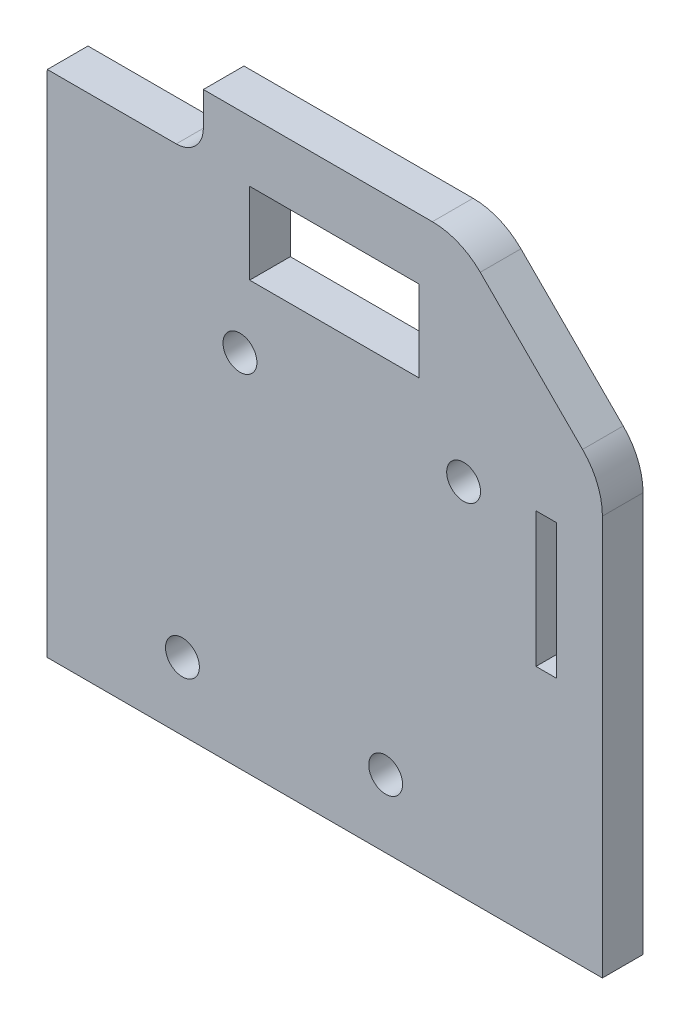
from build123d import *

# Parameters (mm, degrees)
SKETCH1_R           = 2.5
SKETCH1_R_2         = 2.49824948
SKETCH1_W           = 24.999991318
SKETCH1_H           = 12
BOSS_EXTRUDE1_DEPTH = 6
SKETCH2_W           = 3
SKETCH2_H           = 19.898661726
CUT_EXTRUDE1_DEPTH  = 6
CUT_EXTRUDE2_DEPTH  = 10


with BuildPart() as part:
    # Sketch1 → Boss-Extrude1 (new body)
    with BuildSketch(Plane.XY):
        with BuildLine():
            Line((-189.973065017, 51.742278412), (-189.973065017, -7.301419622))
            Line((-189.973065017, -7.301419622), (-271.973088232, -7.301419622))
            Line((-271.973088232, -7.301419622), (-271.973046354, 66.843506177))
            ThreePointArc((-271.973046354, 66.843506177), (-269.044112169, 73.914570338), (-261.973046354, 76.843500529))
            Line((-261.973046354, 76.843500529), (-215.074287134, 76.843500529))
            ThreePointArc((-215.074287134, 76.843500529), (-211.24745281, 76.082295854), (-208.003219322, 73.914568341))
            Line((-208.003219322, 73.914568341), (-192.901997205, 58.813346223))
            ThreePointArc((-192.901997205, 58.813346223), (-190.734269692, 55.569112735), (-189.973065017, 51.742278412))
        make_face()
        with Locations((-251.973065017, 2.698580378)):
            Circle(SKETCH1_R, mode=Mode.SUBTRACT)
        with Locations((-221.971337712, 2.698580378)):
            Circle(SKETCH1_R_2, mode=Mode.SUBTRACT)
        with Locations((-243.482374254, 45.896495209)):
            Circle(SKETCH1_R, mode=Mode.SUBTRACT)
        with Locations((-210.46380221, 45.896495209)):
            Circle(SKETCH1_R, mode=Mode.SUBTRACT)
        with Locations((-229.546610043, 61.884414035)):
            Rectangle(SKETCH1_W, SKETCH1_H, mode=Mode.SUBTRACT)
    extrude(amount=BOSS_EXTRUDE1_DEPTH)

    # Sketch2 → Cut-Extrude1 (cut)
    with BuildSketch(Plane(origin=(0, 0, 0), x_dir=(-1, 0, 0), z_dir=(0, 0, -1))):
        with Locations((198.280083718, 37.580135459)):
            Rectangle(SKETCH2_W, SKETCH2_H)
    extrude(amount=-CUT_EXTRUDE1_DEPTH, mode=Mode.SUBTRACT)

    # Sketch3 → Cut-Extrude2 (cut)
    with BuildSketch(Plane.XY.offset(6)):
        with BuildLine():
            Line((-271.973035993, 67.884414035), (-252.885381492, 67.884414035))
            ThreePointArc((-252.885381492, 67.884414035), (-250.056954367, 69.055986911), (-248.885381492, 71.884414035))
            Line((-248.885381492, 71.884414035), (-248.885381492, 76.843500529))
            Line((-248.885381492, 76.843500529), (-271.973035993, 76.843500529))
            Line((-271.973035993, 76.843500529), (-271.973035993, 67.884414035))
        make_face()
    extrude(amount=-CUT_EXTRUDE2_DEPTH, mode=Mode.SUBTRACT)


solid = part.part
